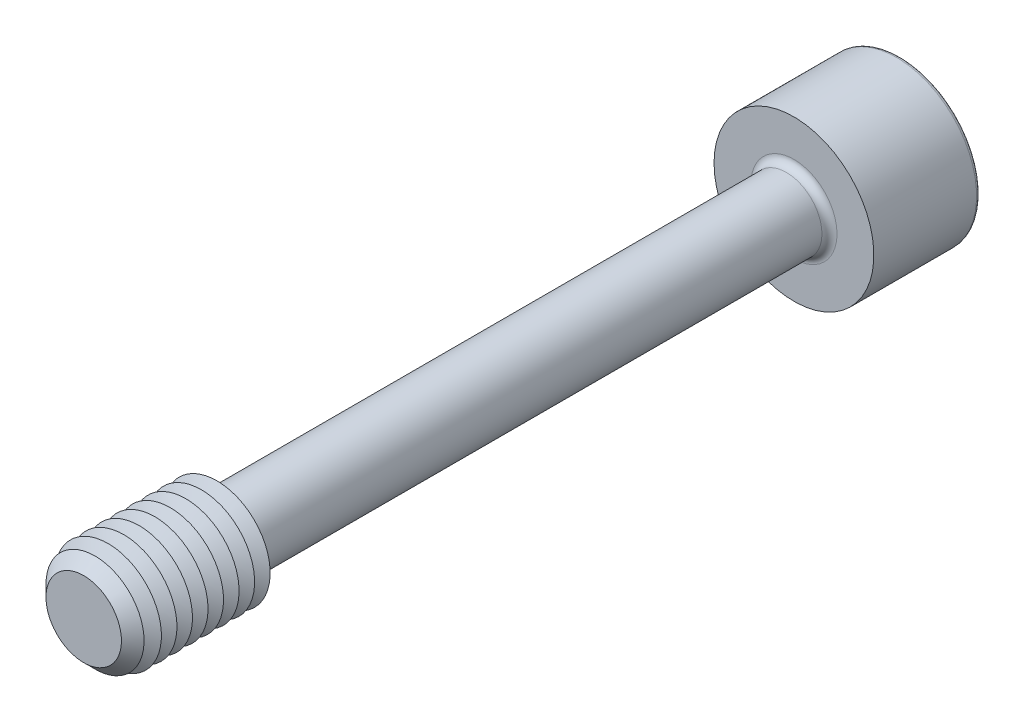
from build123d import *

# Parameters (mm, degrees)
SKETCH1_R       = 4
EXTRUDE1_DEPTH  = 40
CHAMFER1_SIZE   = 1.75
SKETCH3_R       = 9
EXTRUDE2_DEPTH  = 12
EXTRUDE3_DEPTH  = 10
FILLET1_R       = 0.85
FILLET2_R       = 0.425
LPATTERN1_COUNT = 8
LPATTERN1_PITCH = 1.75


with BuildPart() as part:
    # Sketch1 → Extrude1 (new, symmetric)
    with BuildSketch(Plane.XY):
        Circle(SKETCH1_R)
    extrude(amount=EXTRUDE1_DEPTH, both=True)

    # Sketch2 → Revolve1 (revolve)
    with BuildSketch(Plane(origin=(0, 0, 0), x_dir=(0, 0, -1), z_dir=(1, 0, 0))):
        Polygon((-40, 0), (-40, 6), (-25, 6), (-23.845299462, 4), (-23.845299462, 0), align=None)
    revolve(axis=Axis((0, 0, 23.845299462), (0, 0, 1)))

    # Chamfer1
    chamfer1_edges = [part.edges().sort_by_distance(p)[0] for p in [
        (0, -6, 40),
    ]]
    chamfer(chamfer1_edges, length=CHAMFER1_SIZE)

    # Sketch3 → Extrude2 (add)
    with BuildSketch(Plane(origin=(0, 0, -40), x_dir=(-1, 0, 0), z_dir=(0, 0, -1))):
        Circle(SKETCH3_R)
    extrude(amount=EXTRUDE2_DEPTH)

    # Sketch4 → Extrude3 (cut)
    with BuildSketch(Plane(origin=(-13.7, 0, -52), x_dir=(1, 0, 0), z_dir=(0, 0, 1))):
        Polygon((10.813248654, -5), (16.586751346, -5), (19.473502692, 0), (16.586751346, 5), (10.813248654, 5), (7.926497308, 0), align=None)
    extrude(amount=EXTRUDE3_DEPTH, mode=Mode.SUBTRACT)

    # Fillet1
    fillet1_edges = [part.edges().sort_by_distance(p)[0] for p in [
        (-4, 0, -40),
    ]]
    fillet(fillet1_edges, radius=FILLET1_R)

    # Fillet2
    fillet2_edges = [part.edges().sort_by_distance(p)[0] for p in [
        (9, 0, -52),
    ]]
    fillet(fillet2_edges, radius=FILLET2_R)

    # Sketch5 → Cut-Revolve1 (revolve, cut)
    with BuildSketch(Plane(origin=(0, 0, 0), x_dir=(0, 0, -1), z_dir=(1, 0, 0)), mode=Mode.PRIVATE) as cut_revolve1_sk:
        Polygon((42, 0), (42, -5), (39.113248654, 0), align=None)
    revolve(cut_revolve1_sk.sketch.rotate(Axis((0, 0, -39.113248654), (0, 0, -1)), 90), axis=Axis((0, 0, -39.113248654), (0, 0, -1)), mode=Mode.SUBTRACT)

    # Sketch7 → Cut-Revolve2 (revolve, cut)
    with BuildSketch(Plane(origin=(0, 0, 0), x_dir=(0, 0, -1), z_dir=(1, 0, 0)), mode=Mode.PRIVATE) as cut_revolve2_sk:
        Polygon((-25, 6), (-25.875, 4.484455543), (-26.75, 6), align=None)
    cut_revolve2 = revolve(cut_revolve2_sk.sketch.rotate(Axis((0, 0, -1.332048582), (0, 0, 1)), 90), axis=Axis((0, 0, -1.332048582), (0, 0, 1)), mode=Mode.SUBTRACT)

    # LPattern1: Cut-Revolve2 ×8
    with Locations(*[(0, 0, i * LPATTERN1_PITCH) for i in range(1, LPATTERN1_COUNT)]):
        add(cut_revolve2, mode=Mode.SUBTRACT)


solid = part.part
